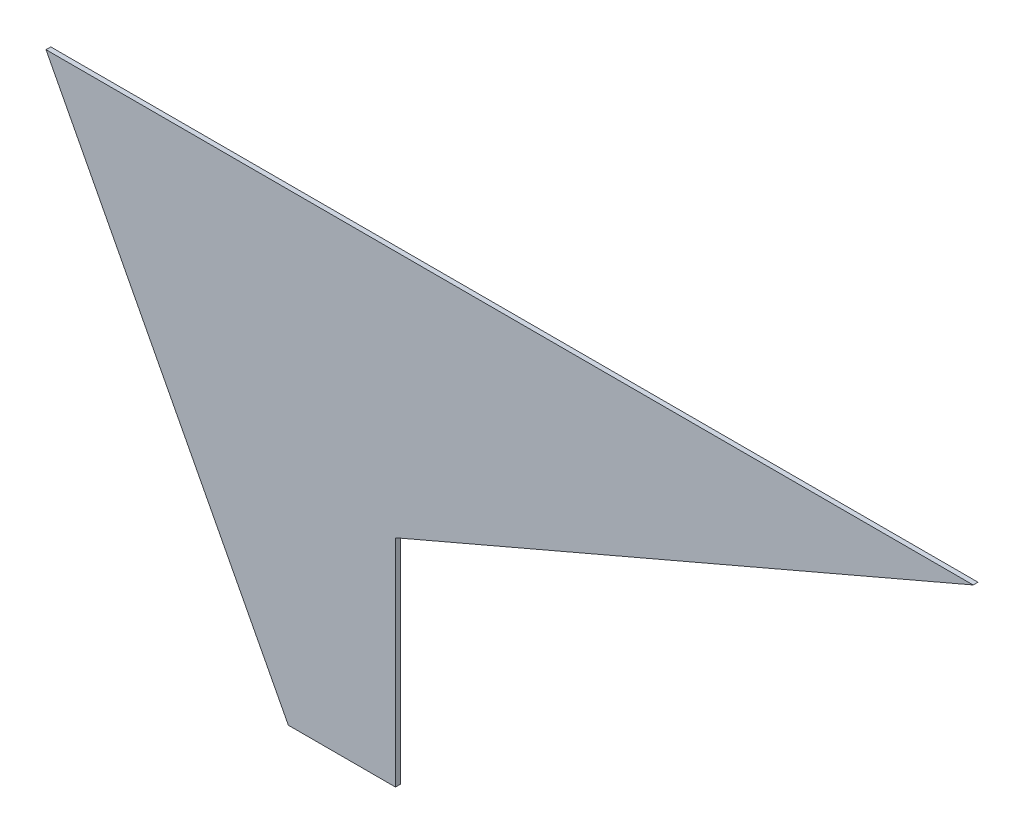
from build123d import *

# Parameters (mm, degrees)
EXTRUDE_1_DEPTH     = 3
SKETCH_2_W          = 151.5
SKETCH_2_H          = 290
CUT_EXTRUDE_1_DEPTH = 3
EXTRUDE_2_DEPTH     = 3


with BuildPart() as part:
    # Sketch 1 → Extrude 1 (new body)
    with BuildSketch(Plane.XY):
        Polygon((-33.5, 0), (33.5, 0), (185, 290), (-185, 290), align=None)
    extrude(amount=EXTRUDE_1_DEPTH)

    # Sketch 2 → Cut-Extrude 1 (cut)
    with BuildSketch(Plane.XY.offset(3)):
        with Locations((109.25, 145)):
            Rectangle(SKETCH_2_W, SKETCH_2_H)
    extrude(amount=-CUT_EXTRUDE_1_DEPTH, mode=Mode.SUBTRACT)

    # Sketch 3 → Extrude 2 (add)
    with BuildSketch(Plane.XY):
        Polygon((33.5, 135), (394.630930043, 290), (33.5, 290), align=None)
    extrude(amount=EXTRUDE_2_DEPTH)


solid = part.part
